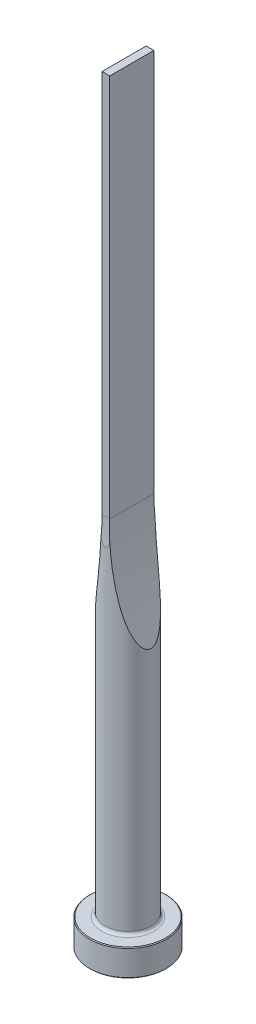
from build123d import *

# Parameters (mm, degrees)
CUT_EXTRUDE1_DEPTH = 7.5
CUT_EXTRUDE2_DEPTH = 7.5


with BuildPart() as part:
    # Sketch1 → Revolve1 (revolve)
    with BuildSketch(Plane.XY, mode=Mode.PRIVATE) as revolve1_sk:
        with BuildLine():
            Line((0, 0), (9.8, 0))
            Line((9.8, 0), (10, 0.2))
            Line((10, 0.2), (10, 6.8))
            Line((10, 6.8), (9.8, 7))
            Line((9.8, 7), (6.8, 7))
            ThreePointArc((6.8, 7), (6.234314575, 7.234314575), (6, 7.8))
            Line((6, 7.8), (6, 200))
            Line((6, 200), (0, 200))
            Line((0, 200), (0, 0))
        make_face()
    revolve(revolve1_sk.sketch.rotate(Axis((0, 200, 0), (0, -1, 0)), 180), axis=Axis((0, 200, 0), (0, -1, 0)))

    # Sketch2 → Cut-Extrude1 (cut, symmetric)
    with BuildSketch(Plane.XY):
        with BuildLine():
            Line((1, 200), (1, 100))
            ThreePointArc((1, 100), (2.258803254, 85), (6, 70.419601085))
            Line((6, 70.419601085), (6, 200))
            Line((6, 200), (1, 200))
        make_face()
        with BuildLine():
            Line((-1, 200), (-1, 100))
            ThreePointArc((-1, 100), (-2.258803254, 85), (-6, 70.419601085))
            Line((-6, 70.419601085), (-6, 200))
            Line((-6, 200), (-1, 200))
        make_face()
    extrude(amount=CUT_EXTRUDE1_DEPTH, both=True, mode=Mode.SUBTRACT)

    # Sketch3 → Cut-Extrude2 (cut, symmetric)
    with BuildSketch(Plane(origin=(0, 0, 0), x_dir=(0, 0, -1), z_dir=(1, 0, 0))):
        with BuildLine():
            Line((5.75, 200), (5.75, 100))
            ThreePointArc((5.75, 100), (5.812521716, 96.645898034), (6, 93.296456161))
            Line((6, 93.296456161), (6, 200))
            Line((6, 200), (5.75, 200))
        make_face()
        with BuildLine():
            Line((-5.75, 200), (-5.75, 100))
            ThreePointArc((-5.75, 100), (-5.812521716, 96.645898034), (-6, 93.296456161))
            Line((-6, 93.296456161), (-6, 200))
            Line((-6, 200), (-5.75, 200))
        make_face()
    extrude(amount=CUT_EXTRUDE2_DEPTH, both=True, mode=Mode.SUBTRACT)


solid = part.part
